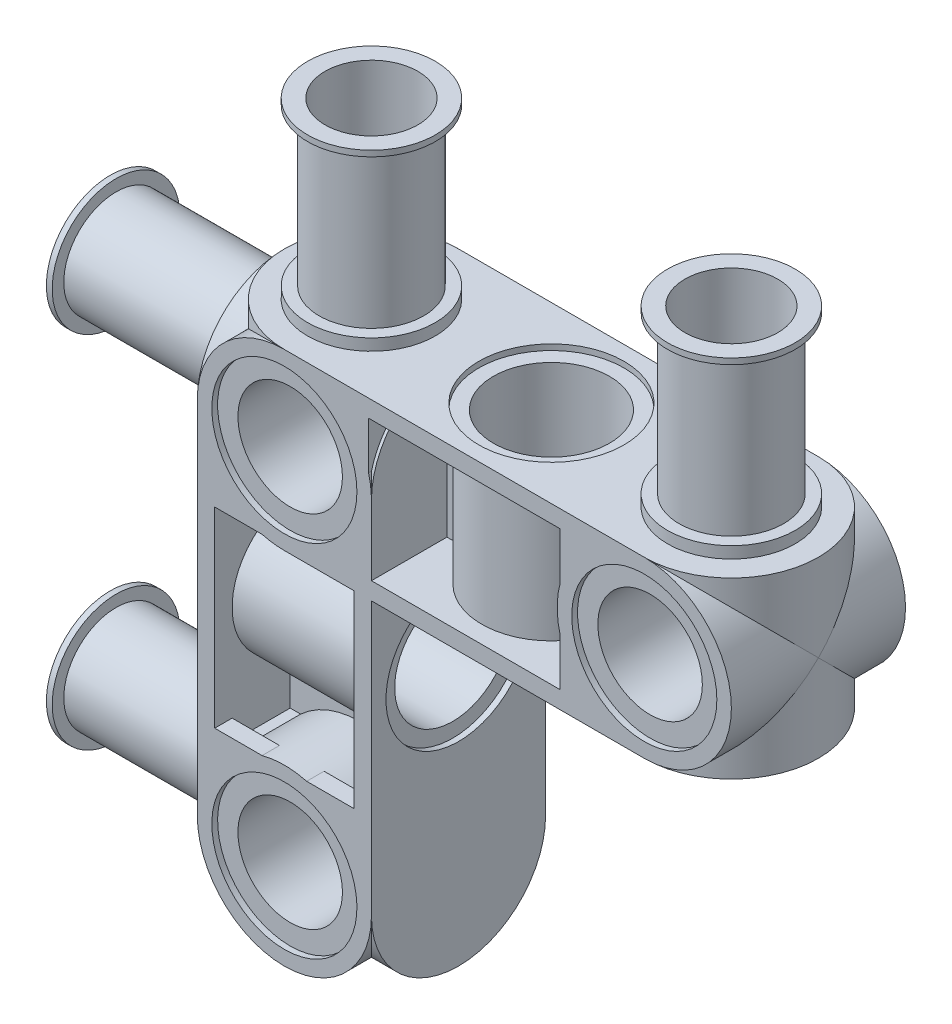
from build123d import *
from build123d.topology import SkipClean

# Parameters (mm, degrees)
EXTRUDE1_DEPTH       = 3.81
SKETCH2_R            = 2.794
CUT_EXTRUDE1_DEPTH   = 0.254
SKETCH3_R            = 2.794
EXTRUDE2_DEPTH       = 0.508
SKETCH5_R            = 2.286
SKETCH5_R_2          = 2.032
EXTRUDE4_DEPTH       = 7.112
EXTRUDE5_START       = -0.254
SKETCH6_R            = 2.794
SKETCH6_R_2          = 2.032
EXTRUDE5_DEPTH       = 0.254
EXTRUDE6_DEPTH       = 7.62
SKETCH8_R            = 2.54
CUT_EXTRUDE2_DEPTH   = 3.556
SKETCH9_R            = 2.286
CUT_EXTRUDE3_DEPTH   = 16.894799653
SKETCH10_R           = 3.175
CUT_EXTRUDE4_DEPTH   = 0.254
CUT_EXTRUDE6_DEPTH   = 3.048
SKETCH13_R           = 2.54
CUT_EXTRUDE7_DEPTH   = 15.595610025
SKETCH14_R           = 3.175
CUT_EXTRUDE8_DEPTH   = 0.254
EXTRUDE8_START       = -7.112
EXTRUDE8_DEPTH       = 7.112
EXTRUDE10_DEPTH      = 21.660054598
EXTRUDE10_DEPTH_BACK = 21.660054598
CIRPATTERN1_COUNT    = 2
CIRPATTERN1_ANGLE    = 90


with BuildPart() as part:
    # Sketch1 → Extrude1 (new body)
    with BuildSketch(Plane(origin=(0, 0, 0), x_dir=(1, 0, 0), z_dir=(0, 1, 0))):
        with BuildLine():
            Line((-7.874, 3.81), (7.874, 3.81))
            ThreePointArc((7.874, 3.81), (11.684, 0), (7.874, -3.81))
            Line((7.874, -3.81), (-7.874, -3.81))
            ThreePointArc((-7.874, -3.81), (-11.684, 0), (-7.874, 3.81))
        make_face()
    extrude(amount=EXTRUDE1_DEPTH)

    # Sketch2 → Cut-Extrude1 (cut)
    with BuildSketch(Plane.XZ):
        with Locations(Location((0, 0, 0), (0, 0, 270))):
            Circle(SKETCH2_R)
    extrude(amount=-CUT_EXTRUDE1_DEPTH, mode=Mode.SUBTRACT)

    # Sketch3 → Extrude2 (add)
    with BuildSketch(Plane.XZ):
        with Locations(Location((7.874, 0, 0), (0, 0, 90))):
            Circle(SKETCH3_R)
        with Locations(Location((-7.874, 0, 0), (0, 0, 90))):
            Circle(SKETCH3_R)
    extrude(amount=EXTRUDE2_DEPTH)

    # Sketch5 → Extrude4 (add)
    # profile 1 of 2: a face of its own
    with BuildSketch(Plane.XZ.offset(0.508)):
        with Locations(Location((7.874, 0, 0), (0, 0, 270))):
            Circle(SKETCH5_R)
        with Locations(Location((7.874, 0, 0), (0, 0, 270))):
            Circle(SKETCH5_R_2, mode=Mode.SUBTRACT)
    # profile 2 of 2: a face of its own
    with BuildSketch(Plane.XZ.offset(0.508)):
        with Locations(Location((-7.874, 0, 0), (0, 0, 270))):
            Circle(SKETCH5_R)
        with Locations(Location((-7.874, 0, 0), (0, 0, 270))):
            Circle(SKETCH5_R_2, mode=Mode.SUBTRACT)
    extrude(amount=EXTRUDE4_DEPTH)

    # Sketch6 → Extrude5 (add)
    # profile 1 of 2: a face of its own
    with BuildSketch(Plane.XZ.offset(7.62).offset(EXTRUDE5_START)):
        with Locations(Location((-7.874, 0, 0), (0, 0, 90))):
            Circle(SKETCH6_R)
        with Locations(Location((-7.874, 0, 0), (0, 0, 270))):
            Circle(SKETCH6_R_2, mode=Mode.SUBTRACT)
    # profile 2 of 2: a face of its own
    with BuildSketch(Plane.XZ.offset(7.62).offset(EXTRUDE5_START)):
        with Locations(Location((7.874, 0, 0), (0, 0, 90))):
            Circle(SKETCH6_R)
        with Locations(Location((7.874, 0, 0), (0, 0, 270))):
            Circle(SKETCH6_R_2, mode=Mode.SUBTRACT)
    extrude(amount=EXTRUDE5_DEPTH)

    # Sketch7 → Extrude6 (add)
    with BuildSketch(Plane(origin=(0, 0, -3.81), x_dir=(-1, 0, 0), z_dir=(0, 0, -1))):
        with BuildLine():
            Line((-7.874, 0), (7.874, 0))
            ThreePointArc((7.874, 0), (10.568076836, 1.115923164), (11.684, 3.81))
            Line((11.684, 3.81), (7.874, 3.81))
            Line((7.874, 3.81), (-7.874, 3.81))
            Line((-7.874, 3.81), (-11.684, 3.81))
            ThreePointArc((-11.684, 3.81), (-10.568076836, 1.115923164), (-7.874, 0))
        make_face()
    extrude(amount=-EXTRUDE6_DEPTH)

    # Sketch8 → Cut-Extrude2 (cut)
    with BuildSketch(Plane(origin=(0, 3.81, 0), x_dir=(1, 0, 0), z_dir=(0, 1, 0))):
        with Locations(Location((0, 0, 0), (0, 0, 270))):
            Circle(SKETCH8_R)
    extrude(amount=-CUT_EXTRUDE2_DEPTH, mode=Mode.SUBTRACT)

    # Sketch9 → Cut-Extrude3 (cut, through all)
    with BuildSketch(Plane.XY.offset(3.81)):
        with Locations((7.874, 3.81)):
            Circle(SKETCH9_R)
        with Locations((-7.874, 3.81)):
            Circle(SKETCH9_R)
    extrude(amount=-CUT_EXTRUDE3_DEPTH, mode=Mode.SUBTRACT)

    # Sketch10 → Cut-Extrude4 (cut)
    with BuildSketch(Plane.XY.offset(3.81)):
        with Locations((7.874, 3.81)):
            Circle(SKETCH10_R)
        with Locations((-7.874, 3.81)):
            Circle(SKETCH10_R)
    cut_extrude4 = extrude(amount=-CUT_EXTRUDE4_DEPTH, mode=Mode.SUBTRACT)

    # Mirror2: Cut-Extrude4 across plane
    add(cut_extrude4.mirror(Plane.XY), mode=Mode.SUBTRACT)

    # Sketch11 → Cut-Extrude6 (cut)
    with BuildSketch(Plane(origin=(0, 3.81, 0), x_dir=(1, 0, 0), z_dir=(0, 1, 0))):
        with BuildLine():
            Line((-5.08, -0.508), (-5.08, -3.048))
            Line((-5.08, -3.048), (-4.191, -3.048))
            Line((-4.191, -3.048), (-4.191, -3.81))
            Line((-4.191, -3.81), (4.191, -3.81))
            Line((4.191, -3.81), (4.191, -3.048))
            Line((4.191, -3.048), (5.08, -3.048))
            Line((5.08, -3.048), (5.08, -0.508))
            Line((5.08, -0.508), (3.00536853, -0.508))
            ThreePointArc((3.00536853, -0.508), (0, -3.048), (-3.00536853, -0.508))
            Line((-3.00536853, -0.508), (-5.08, -0.508))
        make_face()
        with BuildLine():
            Line((5.08, 0.508), (5.08, 3.048))
            Line((5.08, 3.048), (4.191, 3.048))
            Line((4.191, 3.048), (4.191, 3.81))
            Line((4.191, 3.81), (-4.191, 3.81))
            Line((-4.191, 3.81), (-4.191, 3.048))
            Line((-4.191, 3.048), (-5.08, 3.048))
            Line((-5.08, 3.048), (-5.08, 0.508))
            Line((-5.08, 0.508), (-3.00536853, 0.508))
            ThreePointArc((-3.00536853, 0.508), (0, 3.048), (3.00536853, 0.508))
            Line((3.00536853, 0.508), (5.08, 0.508))
        make_face()
    extrude(amount=-CUT_EXTRUDE6_DEPTH, mode=Mode.SUBTRACT)

    # Sketch13 → Cut-Extrude7 (cut, through all)
    with BuildSketch(Plane(origin=(0, 0.254, 0), x_dir=(1, 0, 0), z_dir=(0, 1, 0))):
        with Locations(Location((0, 0, 0), (0, 0, 270))):
            Circle(SKETCH13_R)
    extrude(amount=-CUT_EXTRUDE7_DEPTH, mode=Mode.SUBTRACT)

    # Sketch14 → Cut-Extrude8 (cut)
    with BuildSketch(Plane.XZ):
        with Locations(Location((0, 0, 0), (0, 0, 270))):
            Circle(SKETCH14_R)
    extrude(amount=-CUT_EXTRUDE8_DEPTH, mode=Mode.SUBTRACT)

    # Sketch17 → Extrude8 (add)
    with BuildSketch(Plane.XY.offset(3.81).offset(EXTRUDE8_START)):
        with BuildLine():
            Line((-4.064, 3.81), (-4.699, 3.81))
            ThreePointArc((-4.699, 3.81), (-7.874, 0.635), (-11.049, 3.81))
            Line((-11.049, 3.81), (-11.684, 3.81))
            ThreePointArc((-11.684, 3.81), (-7.874, 0), (-4.064, 3.81))
        make_face()
    extrude8 = extrude(amount=EXTRUDE8_DEPTH)

    # Mirror3: Extrude8 across plane
    add(extrude8.mirror(Plane(origin=(0, 0, 0), x_dir=(0, 0, 1), z_dir=(1, 0, 0))))

    # Mirror1: part across face


with BuildPart() as part_1:
    with SkipClean():  # the faces are left unmerged after this step: merging them gives an invalid solid
        add(part.part)
        add(part.part.mirror(Plane(origin=(0, 3.81, 0.015641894), x_dir=(0, 0, 1), z_dir=(0, 1, 0))))

    # Sketch18 → Extrude10 (cut, two sides: drawn at the far end of the back side and taken through both)
    with SkipClean():  # the faces are left unmerged after this step: merging them gives an invalid solid
        with BuildSketch(Plane.XY.offset(3.81).offset(-EXTRUDE10_DEPTH_BACK)):
            Polygon((-86.695109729, 0), (-14.134519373, 0), (15.632648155, 0), (88.193238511, 0), (88.193238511, -145.121180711), (-86.695109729, -145.121180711), align=None)
        extrude(amount=EXTRUDE10_DEPTH + EXTRUDE10_DEPTH_BACK, mode=Mode.SUBTRACT)


with BuildPart() as cirpattern1_1:
    # CirPattern1: pattern copy
    add(part_1.part.rotate(Axis((-7.874, 3.81, 0), (0, 0, -1)), 1 * CIRPATTERN1_ANGLE / (CIRPATTERN1_COUNT - 1)))


with BuildPart() as body_3:
    # Mirror4: mirrored copy
    add(cirpattern1_1.part.mirror(Plane(origin=(-7.874, 0, 0), x_dir=(0, 0, 1), z_dir=(1, 0, 0))))


with BuildPart() as part_2:
    add(part_1.part)

    # Combine1: union body 3
    add(body_3.part)


solid = part_2.part
